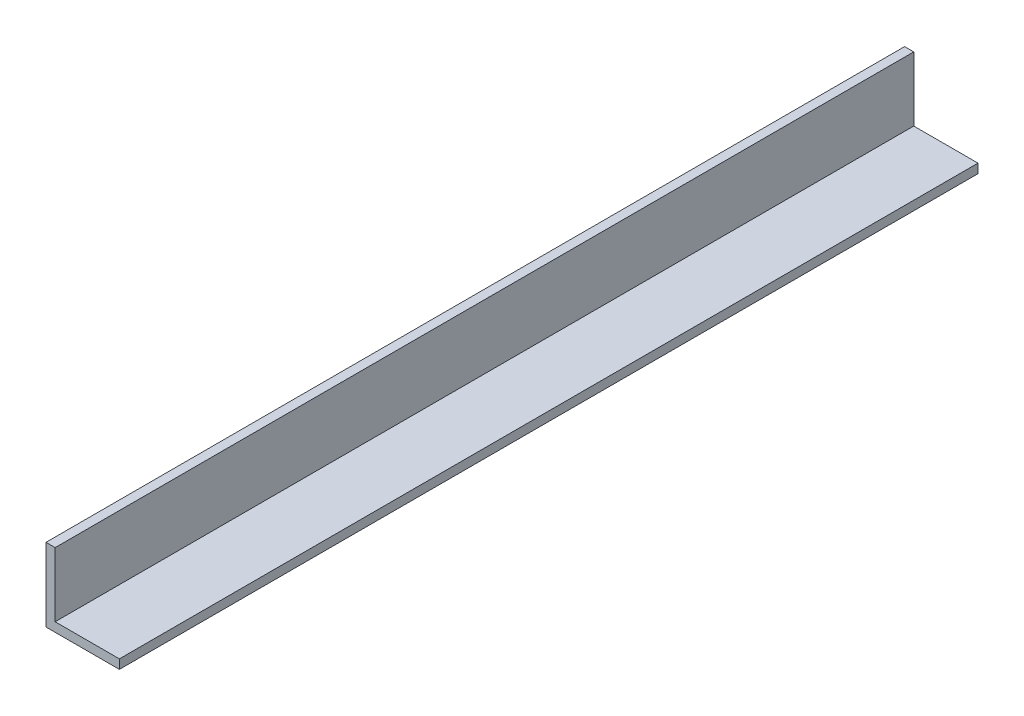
from build123d import *

# Parameters (mm, degrees)
BOSS_EXTRUDE1_DEPTH = 445.77


with BuildPart() as part:
    # Sketch1 → Boss-Extrude1 (new body)
    with BuildSketch(Plane.XY):
        Polygon((0, 0), (0, 38.1), (4.7498, 38.1), (4.7498, 4.7498), (38.1, 4.7498), (38.1, 0), align=None)
    extrude(amount=BOSS_EXTRUDE1_DEPTH)


solid = part.part
